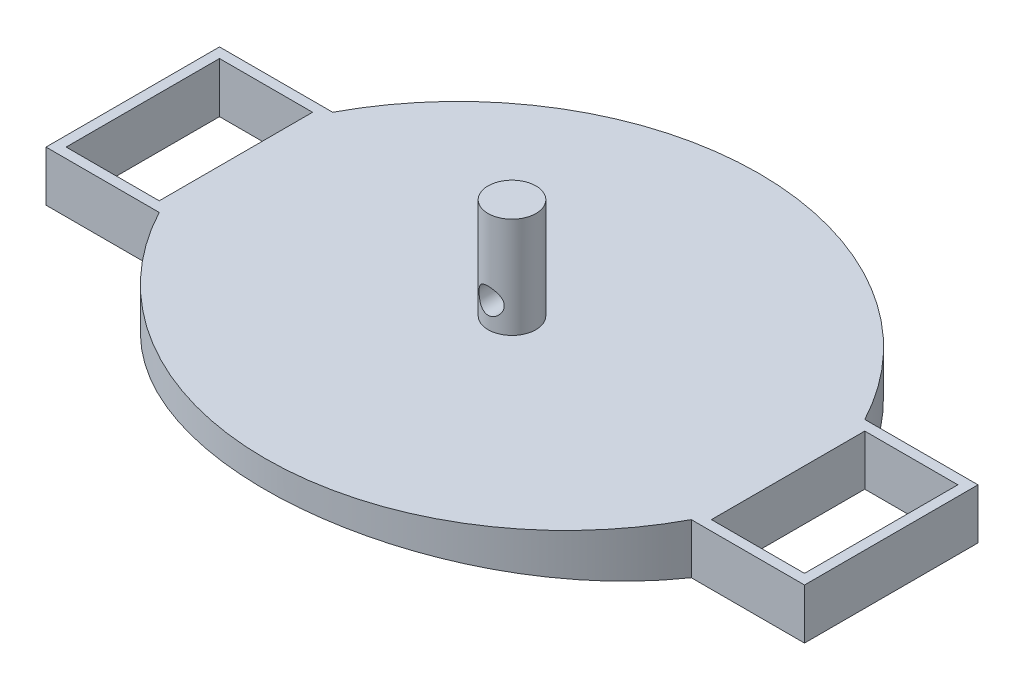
from build123d import *

# Parameters (mm, degrees)
SKETCH4_W               = 18.488801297
SKETCH4_H               = 30.46096825
BOSS_EXTRUDE3_DEPTH     = 10
SKETCH5_R               = 4.75
BOSS_EXTRUDE4_DEPTH     = 20
CUT_EXTRUDE1_REACH      = 99.306
CUT_EXTRUDE1_END_RADIUS = 4.75
SKETCH6_R               = 2.5
CUT_EXTRUDE2_REACH      = 129.264
CUT_EXTRUDE2_END_RADIUS = 59.78872431


with BuildPart() as part:
    # Sketch4 → Boss-Extrude3 (new body)
    with BuildSketch(Plane(origin=(0, 0, 0), x_dir=(1, 0, 0), z_dir=(0, 1, 0))):
        with BuildLine():
            Line((52.840693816, -62.117160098), (75.329495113, -62.117160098))
            Line((75.329495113, -62.117160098), (75.329495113, -27.656191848))
            Line((75.329495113, -27.656191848), (52.840693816, -27.656191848))
            ThreePointArc((52.840693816, -27.656191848), (0, 4.158390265), (-52.840693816, -27.656191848))
            Line((-52.840693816, -27.656191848), (-75.329495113, -27.656191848))
            Line((-75.329495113, -27.656191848), (-75.329495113, -62.117160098))
            Line((-75.329495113, -62.117160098), (-52.840693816, -62.117160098))
            ThreePointArc((-52.840693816, -62.117160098), (0, -93.931742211), (52.840693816, -62.117160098))
        make_face()
        with Locations((64.085094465, -44.886675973)):
            Rectangle(SKETCH4_W, SKETCH4_H, mode=Mode.SUBTRACT)
        with Locations((-64.085094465, -44.886675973)):
            Rectangle(SKETCH4_W, SKETCH4_H, mode=Mode.SUBTRACT)
    extrude(amount=BOSS_EXTRUDE3_DEPTH)

    # Sketch5 → Boss-Extrude4 (add)
    with BuildSketch(Plane(origin=(0, 10, 0), x_dir=(1, 0, 0), z_dir=(0, 1, 0))):
        with Locations(Location((0, -44.886675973, 0), (0, 0, 90))):
            Circle(SKETCH5_R)
    extrude(amount=BOSS_EXTRUDE4_DEPTH)

    # Cut-Extrude1: up to this cylinder (the profile starts inside it)
    cut_extrude1_end = Plane(origin=(0, 15, 44.886675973), z_dir=(0, -1, 0)) * Cylinder(CUT_EXTRUDE1_END_RADIUS, 209.112, mode=Mode.PRIVATE)
    # Sketch6 → Cut-Extrude1 (cut, up to the surface)
    with BuildSketch(Plane(origin=(0, 0, 40.136675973), x_dir=(-1, 0, 0), z_dir=(0, 0, -1)), mode=Mode.PRIVATE) as cut_extrude1_sk1:
        with Locations((0, 15)):
            Circle(SKETCH6_R)
    cut_extrude1_tool1 = extrude(cut_extrude1_sk1.sketch, amount=-CUT_EXTRUDE1_REACH, mode=Mode.PRIVATE) & cut_extrude1_end
    add(cut_extrude1_tool1.solids().sort_by_distance((0, 15, 40.136676))[0], mode=Mode.SUBTRACT)

    # Cut-Extrude2: up to this cylinder (the profile starts inside it)
    cut_extrude2_end = Plane(origin=(0, 1.85701, 55.630334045), z_dir=(0, -1, 0)) * Cylinder(CUT_EXTRUDE2_END_RADIUS, 379.10544862, mode=Mode.PRIVATE)
    # Sketch7 → Cut-Extrude2 (cut, up to the surface)
    with BuildSketch(Plane.XY.offset(93.931742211), mode=Mode.PRIVATE) as cut_extrude2_sk1:
        with BuildLine():
            Line((-52.840693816, 0), (52.840693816, 0))
            ThreePointArc((52.840693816, 0), (0, 4.639468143), (-52.840693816, 0))
        make_face()
    cut_extrude2_tool1 = extrude(cut_extrude2_sk1.sketch, amount=-CUT_EXTRUDE2_REACH, mode=Mode.PRIVATE) & cut_extrude2_end
    add(cut_extrude2_tool1.solids().sort_by_distance((0, 1.85701, 93.931742))[0], mode=Mode.SUBTRACT)


solid = part.part
